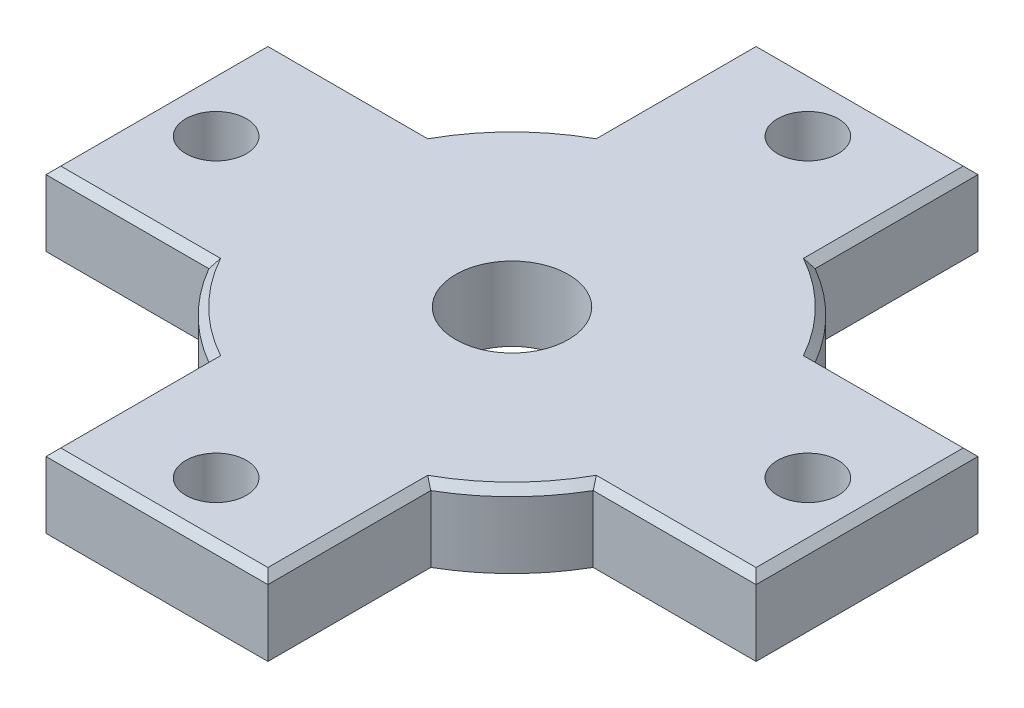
ISO-10303-21;
HEADER;
FILE_DESCRIPTION(('STEP AP214'),'2;1');
FILE_NAME('part.step','',(''),(''),'','','');
FILE_SCHEMA(('AUTOMOTIVE_DESIGN { 1 0 10303 214 1 1 1 1 }'));
ENDSEC;
DATA;
#1=APPLICATION_CONTEXT('core data for automotive mechanical design processes');
#2=APPLICATION_PROTOCOL_DEFINITION('international standard','automotive_design',2000,#1);
#3=PRODUCT_CONTEXT('',#1,'mechanical');
#4=PRODUCT('Part','Part','',(#3));
#5=PRODUCT_RELATED_PRODUCT_CATEGORY('part','',(#4));
#6=PRODUCT_DEFINITION_FORMATION('','',#4);
#7=PRODUCT_DEFINITION_CONTEXT('part definition',#1,'design');
#8=PRODUCT_DEFINITION('design','',#6,#7);
#9=PRODUCT_DEFINITION_SHAPE('','',#8);
#10=(LENGTH_UNIT() NAMED_UNIT(*) SI_UNIT(.MILLI.,.METRE.));
#11=(NAMED_UNIT(*) PLANE_ANGLE_UNIT() SI_UNIT($,.RADIAN.));
#12=(NAMED_UNIT(*) SI_UNIT($,.STERADIAN.) SOLID_ANGLE_UNIT());
#13=UNCERTAINTY_MEASURE_WITH_UNIT(LENGTH_MEASURE(1.E-05),#10,'distance_accuracy_value','');
#14=(GEOMETRIC_REPRESENTATION_CONTEXT(3) GLOBAL_UNCERTAINTY_ASSIGNED_CONTEXT((#13)) GLOBAL_UNIT_ASSIGNED_CONTEXT((#10,
#11,#12)) REPRESENTATION_CONTEXT('',''));
#15=CARTESIAN_POINT('',(0.,0.,0.));
#16=DIRECTION('',(0.,0.,1.));
#17=DIRECTION('',(1.,0.,0.));
#18=AXIS2_PLACEMENT_3D('',#15,#16,#17);
#19=CARTESIAN_POINT('',(0.,10.,0.));
#20=DIRECTION('',(0.,-1.,0.));
#21=DIRECTION('',(0.,0.,-1.));
#22=AXIS2_PLACEMENT_3D('',#19,#20,#21);
#23=CYLINDRICAL_SURFACE('',#22,30.);
#24=DIRECTION('',(0.,-1.,0.));
#25=VECTOR('',#24,1.);
#26=CARTESIAN_POINT('',(-25.9807621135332,10.,-15.));
#27=LINE('',#26,#25);
#28=CARTESIAN_POINT('',(-25.9807621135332,9.00000000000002,-15.));
#29=VERTEX_POINT('',#28);
#30=CARTESIAN_POINT('',(-25.9807621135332,0.,-15.));
#31=VERTEX_POINT('',#30);
#32=EDGE_CURVE('E207',#29,#31,#27,.T.);
#33=ORIENTED_EDGE('',*,*,#32,.F.);
#34=CARTESIAN_POINT('',(0.,9.00000000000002,0.));
#35=DIRECTION('',(0.,1.,0.));
#36=DIRECTION('',(0.,0.,1.));
#37=AXIS2_PLACEMENT_3D('',#34,#35,#36);
#38=CIRCLE('',#37,30.);
#39=CARTESIAN_POINT('',(-15.,9.00000000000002,-25.9807621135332));
#40=VERTEX_POINT('',#39);
#41=EDGE_CURVE('E12',#29,#40,#38,.F.);
#42=ORIENTED_EDGE('',*,*,#41,.T.);
#43=DIRECTION('',(0.,-1.,0.));
#44=VECTOR('',#43,1.);
#45=CARTESIAN_POINT('',(-15.,10.,-25.9807621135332));
#46=LINE('',#45,#44);
#47=CARTESIAN_POINT('',(-15.,0.,-25.9807621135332));
#48=VERTEX_POINT('',#47);
#49=EDGE_CURVE('E228',#40,#48,#46,.T.);
#50=ORIENTED_EDGE('',*,*,#49,.T.);
#51=CARTESIAN_POINT('',(0.,0.,0.));
#52=DIRECTION('',(0.,1.,0.));
#53=DIRECTION('',(0.,0.,1.));
#54=AXIS2_PLACEMENT_3D('',#51,#52,#53);
#55=CIRCLE('',#54,30.);
#56=EDGE_CURVE('E222',#48,#31,#55,.T.);
#57=ORIENTED_EDGE('',*,*,#56,.T.);
#58=EDGE_LOOP('',(#33,#42,#50,#57));
#59=FACE_BOUND('',#58,.T.);
#60=ADVANCED_FACE('F41',(#59),#23,.T.);
#61=CARTESIAN_POINT('',(-48.,10.,-15.));
#62=DIRECTION('',(0.,0.,1.));
#63=DIRECTION('',(1.,0.,0.));
#64=AXIS2_PLACEMENT_3D('',#61,#62,#63);
#65=PLANE('',#64);
#66=DIRECTION('',(0.,-1.,0.));
#67=VECTOR('',#66,1.);
#68=CARTESIAN_POINT('',(-48.,10.,-15.));
#69=LINE('',#68,#67);
#70=CARTESIAN_POINT('',(-48.,9.00000000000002,-15.));
#71=VERTEX_POINT('',#70);
#72=CARTESIAN_POINT('',(-48.,0.,-15.));
#73=VERTEX_POINT('',#72);
#74=EDGE_CURVE('E216',#71,#73,#69,.T.);
#75=ORIENTED_EDGE('',*,*,#74,.F.);
#76=DIRECTION('',(1.,0.,0.));
#77=VECTOR('',#76,1.);
#78=CARTESIAN_POINT('',(-25.9807621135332,9.00000000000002,-15.));
#79=LINE('',#78,#77);
#80=EDGE_CURVE('E56',#71,#29,#79,.T.);
#81=ORIENTED_EDGE('',*,*,#80,.T.);
#82=ORIENTED_EDGE('',*,*,#32,.T.);
#83=DIRECTION('',(-1.,0.,0.));
#84=VECTOR('',#83,1.);
#85=CARTESIAN_POINT('',(-48.,0.,-15.));
#86=LINE('',#85,#84);
#87=EDGE_CURVE('E210',#31,#73,#86,.T.);
#88=ORIENTED_EDGE('',*,*,#87,.T.);
#89=EDGE_LOOP('',(#75,#81,#82,#88));
#90=FACE_BOUND('',#89,.T.);
#91=ADVANCED_FACE('F209',(#90),#65,.F.);
#92=CARTESIAN_POINT('',(-48.,10.,15.));
#93=DIRECTION('',(1.,0.,0.));
#94=DIRECTION('',(0.,0.,-1.));
#95=AXIS2_PLACEMENT_3D('',#92,#93,#94);
#96=PLANE('',#95);
#97=DIRECTION('',(0.,-1.,0.));
#98=VECTOR('',#97,1.);
#99=CARTESIAN_POINT('',(-48.,10.,15.));
#100=LINE('',#99,#98);
#101=CARTESIAN_POINT('',(-48.,9.00000000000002,15.));
#102=VERTEX_POINT('',#101);
#103=CARTESIAN_POINT('',(-48.,0.,15.));
#104=VERTEX_POINT('',#103);
#105=EDGE_CURVE('E301',#102,#104,#100,.T.);
#106=ORIENTED_EDGE('',*,*,#105,.F.);
#107=DIRECTION('',(0.,0.,-1.));
#108=VECTOR('',#107,1.);
#109=CARTESIAN_POINT('',(-48.,9.00000000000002,-15.));
#110=LINE('',#109,#108);
#111=EDGE_CURVE('E71',#102,#71,#110,.T.);
#112=ORIENTED_EDGE('',*,*,#111,.T.);
#113=ORIENTED_EDGE('',*,*,#74,.T.);
#114=DIRECTION('',(0.,0.,1.));
#115=VECTOR('',#114,1.);
#116=CARTESIAN_POINT('',(-48.,0.,15.));
#117=LINE('',#116,#115);
#118=EDGE_CURVE('E225',#73,#104,#117,.T.);
#119=ORIENTED_EDGE('',*,*,#118,.T.);
#120=EDGE_LOOP('',(#106,#112,#113,#119));
#121=FACE_BOUND('',#120,.T.);
#122=ADVANCED_FACE('F549',(#121),#96,.F.);
#123=CARTESIAN_POINT('',(-25.9807621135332,10.,15.));
#124=DIRECTION('',(0.,0.,-1.));
#125=DIRECTION('',(-1.,0.,0.));
#126=AXIS2_PLACEMENT_3D('',#123,#124,#125);
#127=PLANE('',#126);
#128=DIRECTION('',(0.,-1.,0.));
#129=VECTOR('',#128,1.);
#130=CARTESIAN_POINT('',(-25.9807621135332,10.,15.));
#131=LINE('',#130,#129);
#132=CARTESIAN_POINT('',(-25.9807621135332,9.00000000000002,15.));
#133=VERTEX_POINT('',#132);
#134=CARTESIAN_POINT('',(-25.9807621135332,0.,15.));
#135=VERTEX_POINT('',#134);
#136=EDGE_CURVE('E299',#133,#135,#131,.T.);
#137=ORIENTED_EDGE('',*,*,#136,.F.);
#138=DIRECTION('',(-1.,0.,0.));
#139=VECTOR('',#138,1.);
#140=CARTESIAN_POINT('',(-48.,9.00000000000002,15.));
#141=LINE('',#140,#139);
#142=EDGE_CURVE('E361',#133,#102,#141,.T.);
#143=ORIENTED_EDGE('',*,*,#142,.T.);
#144=ORIENTED_EDGE('',*,*,#105,.T.);
#145=DIRECTION('',(1.,0.,0.));
#146=VECTOR('',#145,1.);
#147=CARTESIAN_POINT('',(-25.9807621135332,0.,15.));
#148=LINE('',#147,#146);
#149=EDGE_CURVE('E238',#104,#135,#148,.T.);
#150=ORIENTED_EDGE('',*,*,#149,.T.);
#151=EDGE_LOOP('',(#137,#143,#144,#150));
#152=FACE_BOUND('',#151,.T.);
#153=ADVANCED_FACE('F512',(#152),#127,.F.);
#154=CARTESIAN_POINT('',(0.,10.,0.));
#155=DIRECTION('',(0.,-1.,0.));
#156=DIRECTION('',(0.,0.,-1.));
#157=AXIS2_PLACEMENT_3D('',#154,#155,#156);
#158=CYLINDRICAL_SURFACE('',#157,30.);
#159=DIRECTION('',(0.,-1.,0.));
#160=VECTOR('',#159,1.);
#161=CARTESIAN_POINT('',(-15.,10.,25.9807621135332));
#162=LINE('',#161,#160);
#163=CARTESIAN_POINT('',(-15.,9.00000000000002,25.9807621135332));
#164=VERTEX_POINT('',#163);
#165=CARTESIAN_POINT('',(-15.,0.,25.9807621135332));
#166=VERTEX_POINT('',#165);
#167=EDGE_CURVE('E297',#164,#166,#162,.T.);
#168=ORIENTED_EDGE('',*,*,#167,.F.);
#169=CARTESIAN_POINT('',(0.,9.00000000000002,0.));
#170=DIRECTION('',(0.,1.,0.));
#171=DIRECTION('',(0.,0.,1.));
#172=AXIS2_PLACEMENT_3D('',#169,#170,#171);
#173=CIRCLE('',#172,30.);
#174=EDGE_CURVE('E359',#164,#133,#173,.F.);
#175=ORIENTED_EDGE('',*,*,#174,.T.);
#176=ORIENTED_EDGE('',*,*,#136,.T.);
#177=CARTESIAN_POINT('',(0.,0.,0.));
#178=DIRECTION('',(0.,1.,0.));
#179=DIRECTION('',(0.,0.,1.));
#180=AXIS2_PLACEMENT_3D('',#177,#178,#179);
#181=CIRCLE('',#180,30.);
#182=EDGE_CURVE('E241',#135,#166,#181,.T.);
#183=ORIENTED_EDGE('',*,*,#182,.T.);
#184=EDGE_LOOP('',(#168,#175,#176,#183));
#185=FACE_BOUND('',#184,.T.);
#186=ADVANCED_FACE('F510',(#185),#158,.T.);
#187=CARTESIAN_POINT('',(-15.,10.,48.));
#188=DIRECTION('',(1.,0.,0.));
#189=DIRECTION('',(0.,0.,-1.));
#190=AXIS2_PLACEMENT_3D('',#187,#188,#189);
#191=PLANE('',#190);
#192=DIRECTION('',(0.,-1.,0.));
#193=VECTOR('',#192,1.);
#194=CARTESIAN_POINT('',(-15.,10.,48.));
#195=LINE('',#194,#193);
#196=CARTESIAN_POINT('',(-15.,9.00000000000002,48.));
#197=VERTEX_POINT('',#196);
#198=CARTESIAN_POINT('',(-15.,0.,48.));
#199=VERTEX_POINT('',#198);
#200=EDGE_CURVE('E295',#197,#199,#195,.T.);
#201=ORIENTED_EDGE('',*,*,#200,.F.);
#202=DIRECTION('',(0.,0.,-1.));
#203=VECTOR('',#202,1.);
#204=CARTESIAN_POINT('',(-15.,9.00000000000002,25.9807621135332));
#205=LINE('',#204,#203);
#206=EDGE_CURVE('E357',#197,#164,#205,.T.);
#207=ORIENTED_EDGE('',*,*,#206,.T.);
#208=ORIENTED_EDGE('',*,*,#167,.T.);
#209=DIRECTION('',(0.,0.,1.));
#210=VECTOR('',#209,1.);
#211=CARTESIAN_POINT('',(-15.,0.,48.));
#212=LINE('',#211,#210);
#213=EDGE_CURVE('E244',#166,#199,#212,.T.);
#214=ORIENTED_EDGE('',*,*,#213,.T.);
#215=EDGE_LOOP('',(#201,#207,#208,#214));
#216=FACE_BOUND('',#215,.T.);
#217=ADVANCED_FACE('F519',(#216),#191,.F.);
#218=CARTESIAN_POINT('',(15.,10.,48.));
#219=DIRECTION('',(0.,0.,-1.));
#220=DIRECTION('',(-1.,0.,0.));
#221=AXIS2_PLACEMENT_3D('',#218,#219,#220);
#222=PLANE('',#221);
#223=DIRECTION('',(0.,-1.,0.));
#224=VECTOR('',#223,1.);
#225=CARTESIAN_POINT('',(15.,10.,48.));
#226=LINE('',#225,#224);
#227=CARTESIAN_POINT('',(15.,9.00000000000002,48.));
#228=VERTEX_POINT('',#227);
#229=CARTESIAN_POINT('',(15.,0.,48.));
#230=VERTEX_POINT('',#229);
#231=EDGE_CURVE('E293',#228,#230,#226,.T.);
#232=ORIENTED_EDGE('',*,*,#231,.F.);
#233=DIRECTION('',(-1.,0.,0.));
#234=VECTOR('',#233,1.);
#235=CARTESIAN_POINT('',(-15.,9.00000000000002,48.));
#236=LINE('',#235,#234);
#237=EDGE_CURVE('E355',#228,#197,#236,.T.);
#238=ORIENTED_EDGE('',*,*,#237,.T.);
#239=ORIENTED_EDGE('',*,*,#200,.T.);
#240=DIRECTION('',(1.,0.,0.));
#241=VECTOR('',#240,1.);
#242=CARTESIAN_POINT('',(15.,0.,48.));
#243=LINE('',#242,#241);
#244=EDGE_CURVE('E247',#199,#230,#243,.T.);
#245=ORIENTED_EDGE('',*,*,#244,.T.);
#246=EDGE_LOOP('',(#232,#238,#239,#245));
#247=FACE_BOUND('',#246,.T.);
#248=ADVANCED_FACE('F560',(#247),#222,.F.);
#249=CARTESIAN_POINT('',(15.,10.,25.9807621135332));
#250=DIRECTION('',(-1.,0.,0.));
#251=DIRECTION('',(0.,0.,1.));
#252=AXIS2_PLACEMENT_3D('',#249,#250,#251);
#253=PLANE('',#252);
#254=DIRECTION('',(0.,-1.,0.));
#255=VECTOR('',#254,1.);
#256=CARTESIAN_POINT('',(15.,10.,25.9807621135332));
#257=LINE('',#256,#255);
#258=CARTESIAN_POINT('',(15.,9.00000000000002,25.9807621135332));
#259=VERTEX_POINT('',#258);
#260=CARTESIAN_POINT('',(15.,0.,25.9807621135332));
#261=VERTEX_POINT('',#260);
#262=EDGE_CURVE('E291',#259,#261,#257,.T.);
#263=ORIENTED_EDGE('',*,*,#262,.F.);
#264=DIRECTION('',(0.,0.,1.));
#265=VECTOR('',#264,1.);
#266=CARTESIAN_POINT('',(15.,9.00000000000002,48.));
#267=LINE('',#266,#265);
#268=EDGE_CURVE('E353',#259,#228,#267,.T.);
#269=ORIENTED_EDGE('',*,*,#268,.T.);
#270=ORIENTED_EDGE('',*,*,#231,.T.);
#271=DIRECTION('',(0.,0.,-1.));
#272=VECTOR('',#271,1.);
#273=CARTESIAN_POINT('',(15.,0.,25.9807621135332));
#274=LINE('',#273,#272);
#275=EDGE_CURVE('E250',#230,#261,#274,.T.);
#276=ORIENTED_EDGE('',*,*,#275,.T.);
#277=EDGE_LOOP('',(#263,#269,#270,#276));
#278=FACE_BOUND('',#277,.T.);
#279=ADVANCED_FACE('F563',(#278),#253,.F.);
#280=CARTESIAN_POINT('',(0.,10.,0.));
#281=DIRECTION('',(0.,-1.,0.));
#282=DIRECTION('',(0.,0.,-1.));
#283=AXIS2_PLACEMENT_3D('',#280,#281,#282);
#284=CYLINDRICAL_SURFACE('',#283,30.);
#285=DIRECTION('',(0.,-1.,0.));
#286=VECTOR('',#285,1.);
#287=CARTESIAN_POINT('',(25.9807621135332,10.,15.));
#288=LINE('',#287,#286);
#289=CARTESIAN_POINT('',(25.9807621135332,9.00000000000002,15.));
#290=VERTEX_POINT('',#289);
#291=CARTESIAN_POINT('',(25.9807621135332,0.,15.));
#292=VERTEX_POINT('',#291);
#293=EDGE_CURVE('E289',#290,#292,#288,.T.);
#294=ORIENTED_EDGE('',*,*,#293,.F.);
#295=CARTESIAN_POINT('',(0.,9.00000000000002,0.));
#296=DIRECTION('',(0.,1.,0.));
#297=DIRECTION('',(0.,0.,1.));
#298=AXIS2_PLACEMENT_3D('',#295,#296,#297);
#299=CIRCLE('',#298,30.);
#300=EDGE_CURVE('E351',#290,#259,#299,.F.);
#301=ORIENTED_EDGE('',*,*,#300,.T.);
#302=ORIENTED_EDGE('',*,*,#262,.T.);
#303=CARTESIAN_POINT('',(0.,0.,0.));
#304=DIRECTION('',(0.,1.,0.));
#305=DIRECTION('',(0.,0.,1.));
#306=AXIS2_PLACEMENT_3D('',#303,#304,#305);
#307=CIRCLE('',#306,30.);
#308=EDGE_CURVE('E253',#261,#292,#307,.T.);
#309=ORIENTED_EDGE('',*,*,#308,.T.);
#310=EDGE_LOOP('',(#294,#301,#302,#309));
#311=FACE_BOUND('',#310,.T.);
#312=ADVANCED_FACE('F535',(#311),#284,.T.);
#313=CARTESIAN_POINT('',(48.,10.,15.));
#314=DIRECTION('',(0.,0.,-1.));
#315=DIRECTION('',(-1.,0.,0.));
#316=AXIS2_PLACEMENT_3D('',#313,#314,#315);
#317=PLANE('',#316);
#318=DIRECTION('',(0.,-1.,0.));
#319=VECTOR('',#318,1.);
#320=CARTESIAN_POINT('',(48.,10.,15.));
#321=LINE('',#320,#319);
#322=CARTESIAN_POINT('',(48.,9.00000000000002,15.));
#323=VERTEX_POINT('',#322);
#324=CARTESIAN_POINT('',(48.,0.,15.));
#325=VERTEX_POINT('',#324);
#326=EDGE_CURVE('E287',#323,#325,#321,.T.);
#327=ORIENTED_EDGE('',*,*,#326,.F.);
#328=DIRECTION('',(-1.,0.,0.));
#329=VECTOR('',#328,1.);
#330=CARTESIAN_POINT('',(25.9807621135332,9.00000000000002,15.));
#331=LINE('',#330,#329);
#332=EDGE_CURVE('E349',#323,#290,#331,.T.);
#333=ORIENTED_EDGE('',*,*,#332,.T.);
#334=ORIENTED_EDGE('',*,*,#293,.T.);
#335=DIRECTION('',(1.,0.,0.));
#336=VECTOR('',#335,1.);
#337=CARTESIAN_POINT('',(48.,0.,15.));
#338=LINE('',#337,#336);
#339=EDGE_CURVE('E256',#292,#325,#338,.T.);
#340=ORIENTED_EDGE('',*,*,#339,.T.);
#341=EDGE_LOOP('',(#327,#333,#334,#340));
#342=FACE_BOUND('',#341,.T.);
#343=ADVANCED_FACE('F532',(#342),#317,.F.);
#344=CARTESIAN_POINT('',(48.,10.,-15.));
#345=DIRECTION('',(-1.,0.,0.));
#346=DIRECTION('',(0.,0.,1.));
#347=AXIS2_PLACEMENT_3D('',#344,#345,#346);
#348=PLANE('',#347);
#349=DIRECTION('',(0.,-1.,0.));
#350=VECTOR('',#349,1.);
#351=CARTESIAN_POINT('',(48.,10.,-15.));
#352=LINE('',#351,#350);
#353=CARTESIAN_POINT('',(48.,9.00000000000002,-15.));
#354=VERTEX_POINT('',#353);
#355=CARTESIAN_POINT('',(48.,0.,-15.));
#356=VERTEX_POINT('',#355);
#357=EDGE_CURVE('E285',#354,#356,#352,.T.);
#358=ORIENTED_EDGE('',*,*,#357,.F.);
#359=DIRECTION('',(0.,0.,1.));
#360=VECTOR('',#359,1.);
#361=CARTESIAN_POINT('',(48.,9.00000000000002,15.));
#362=LINE('',#361,#360);
#363=EDGE_CURVE('E347',#354,#323,#362,.T.);
#364=ORIENTED_EDGE('',*,*,#363,.T.);
#365=ORIENTED_EDGE('',*,*,#326,.T.);
#366=DIRECTION('',(0.,0.,-1.));
#367=VECTOR('',#366,1.);
#368=CARTESIAN_POINT('',(48.,0.,-15.));
#369=LINE('',#368,#367);
#370=EDGE_CURVE('E259',#325,#356,#369,.T.);
#371=ORIENTED_EDGE('',*,*,#370,.T.);
#372=EDGE_LOOP('',(#358,#364,#365,#371));
#373=FACE_BOUND('',#372,.T.);
#374=ADVANCED_FACE('F571',(#373),#348,.F.);
#375=CARTESIAN_POINT('',(25.9807621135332,10.,-15.));
#376=DIRECTION('',(0.,0.,1.));
#377=DIRECTION('',(1.,0.,0.));
#378=AXIS2_PLACEMENT_3D('',#375,#376,#377);
#379=PLANE('',#378);
#380=DIRECTION('',(0.,-1.,0.));
#381=VECTOR('',#380,1.);
#382=CARTESIAN_POINT('',(25.9807621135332,10.,-15.));
#383=LINE('',#382,#381);
#384=CARTESIAN_POINT('',(25.9807621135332,9.00000000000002,-15.));
#385=VERTEX_POINT('',#384);
#386=CARTESIAN_POINT('',(25.9807621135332,0.,-15.));
#387=VERTEX_POINT('',#386);
#388=EDGE_CURVE('E283',#385,#387,#383,.T.);
#389=ORIENTED_EDGE('',*,*,#388,.F.);
#390=DIRECTION('',(1.,0.,0.));
#391=VECTOR('',#390,1.);
#392=CARTESIAN_POINT('',(48.,9.00000000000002,-15.));
#393=LINE('',#392,#391);
#394=EDGE_CURVE('E345',#385,#354,#393,.T.);
#395=ORIENTED_EDGE('',*,*,#394,.T.);
#396=ORIENTED_EDGE('',*,*,#357,.T.);
#397=DIRECTION('',(-1.,0.,0.));
#398=VECTOR('',#397,1.);
#399=CARTESIAN_POINT('',(25.9807621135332,0.,-15.));
#400=LINE('',#399,#398);
#401=EDGE_CURVE('E262',#356,#387,#400,.T.);
#402=ORIENTED_EDGE('',*,*,#401,.T.);
#403=EDGE_LOOP('',(#389,#395,#396,#402));
#404=FACE_BOUND('',#403,.T.);
#405=ADVANCED_FACE('F574',(#404),#379,.F.);
#406=CARTESIAN_POINT('',(0.,10.,0.));
#407=DIRECTION('',(0.,-1.,0.));
#408=DIRECTION('',(0.,0.,-1.));
#409=AXIS2_PLACEMENT_3D('',#406,#407,#408);
#410=CYLINDRICAL_SURFACE('',#409,30.);
#411=DIRECTION('',(0.,-1.,0.));
#412=VECTOR('',#411,1.);
#413=CARTESIAN_POINT('',(15.,10.,-25.9807621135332));
#414=LINE('',#413,#412);
#415=CARTESIAN_POINT('',(15.,9.00000000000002,-25.9807621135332));
#416=VERTEX_POINT('',#415);
#417=CARTESIAN_POINT('',(15.,0.,-25.9807621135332));
#418=VERTEX_POINT('',#417);
#419=EDGE_CURVE('E281',#416,#418,#414,.T.);
#420=ORIENTED_EDGE('',*,*,#419,.F.);
#421=CARTESIAN_POINT('',(0.,9.00000000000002,0.));
#422=DIRECTION('',(0.,1.,0.));
#423=DIRECTION('',(0.,0.,1.));
#424=AXIS2_PLACEMENT_3D('',#421,#422,#423);
#425=CIRCLE('',#424,30.);
#426=EDGE_CURVE('E343',#416,#385,#425,.F.);
#427=ORIENTED_EDGE('',*,*,#426,.T.);
#428=ORIENTED_EDGE('',*,*,#388,.T.);
#429=CARTESIAN_POINT('',(0.,0.,0.));
#430=DIRECTION('',(0.,1.,0.));
#431=DIRECTION('',(0.,0.,1.));
#432=AXIS2_PLACEMENT_3D('',#429,#430,#431);
#433=CIRCLE('',#432,30.);
#434=EDGE_CURVE('E265',#387,#418,#433,.T.);
#435=ORIENTED_EDGE('',*,*,#434,.T.);
#436=EDGE_LOOP('',(#420,#427,#428,#435));
#437=FACE_BOUND('',#436,.T.);
#438=ADVANCED_FACE('F578',(#437),#410,.T.);
#439=CARTESIAN_POINT('',(15.,10.,-48.));
#440=DIRECTION('',(-1.,0.,0.));
#441=DIRECTION('',(0.,0.,1.));
#442=AXIS2_PLACEMENT_3D('',#439,#440,#441);
#443=PLANE('',#442);
#444=DIRECTION('',(0.,-1.,0.));
#445=VECTOR('',#444,1.);
#446=CARTESIAN_POINT('',(15.,10.,-48.));
#447=LINE('',#446,#445);
#448=CARTESIAN_POINT('',(15.,9.00000000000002,-48.));
#449=VERTEX_POINT('',#448);
#450=CARTESIAN_POINT('',(15.,0.,-48.));
#451=VERTEX_POINT('',#450);
#452=EDGE_CURVE('E279',#449,#451,#447,.T.);
#453=ORIENTED_EDGE('',*,*,#452,.F.);
#454=DIRECTION('',(0.,0.,1.));
#455=VECTOR('',#454,1.);
#456=CARTESIAN_POINT('',(15.,9.00000000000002,-25.9807621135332));
#457=LINE('',#456,#455);
#458=EDGE_CURVE('E341',#449,#416,#457,.T.);
#459=ORIENTED_EDGE('',*,*,#458,.T.);
#460=ORIENTED_EDGE('',*,*,#419,.T.);
#461=DIRECTION('',(0.,0.,-1.));
#462=VECTOR('',#461,1.);
#463=CARTESIAN_POINT('',(15.,0.,-48.));
#464=LINE('',#463,#462);
#465=EDGE_CURVE('E268',#418,#451,#464,.T.);
#466=ORIENTED_EDGE('',*,*,#465,.T.);
#467=EDGE_LOOP('',(#453,#459,#460,#466));
#468=FACE_BOUND('',#467,.T.);
#469=ADVANCED_FACE('F582',(#468),#443,.F.);
#470=CARTESIAN_POINT('',(-15.,10.,-48.));
#471=DIRECTION('',(0.,0.,1.));
#472=DIRECTION('',(1.,0.,0.));
#473=AXIS2_PLACEMENT_3D('',#470,#471,#472);
#474=PLANE('',#473);
#475=DIRECTION('',(0.,-1.,0.));
#476=VECTOR('',#475,1.);
#477=CARTESIAN_POINT('',(-15.,10.,-48.));
#478=LINE('',#477,#476);
#479=CARTESIAN_POINT('',(-15.,9.00000000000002,-48.));
#480=VERTEX_POINT('',#479);
#481=CARTESIAN_POINT('',(-15.,0.,-48.));
#482=VERTEX_POINT('',#481);
#483=EDGE_CURVE('E277',#480,#482,#478,.T.);
#484=ORIENTED_EDGE('',*,*,#483,.F.);
#485=DIRECTION('',(1.,0.,0.));
#486=VECTOR('',#485,1.);
#487=CARTESIAN_POINT('',(15.,9.00000000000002,-48.));
#488=LINE('',#487,#486);
#489=EDGE_CURVE('E339',#480,#449,#488,.T.);
#490=ORIENTED_EDGE('',*,*,#489,.T.);
#491=ORIENTED_EDGE('',*,*,#452,.T.);
#492=DIRECTION('',(-1.,0.,0.));
#493=VECTOR('',#492,1.);
#494=CARTESIAN_POINT('',(-15.,0.,-48.));
#495=LINE('',#494,#493);
#496=EDGE_CURVE('E271',#451,#482,#495,.T.);
#497=ORIENTED_EDGE('',*,*,#496,.T.);
#498=EDGE_LOOP('',(#484,#490,#491,#497));
#499=FACE_BOUND('',#498,.T.);
#500=ADVANCED_FACE('F586',(#499),#474,.F.);
#501=CARTESIAN_POINT('',(-15.,10.,-25.9807621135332));
#502=DIRECTION('',(1.,0.,0.));
#503=DIRECTION('',(0.,0.,-1.));
#504=AXIS2_PLACEMENT_3D('',#501,#502,#503);
#505=PLANE('',#504);
#506=ORIENTED_EDGE('',*,*,#49,.F.);
#507=DIRECTION('',(0.,0.,-1.));
#508=VECTOR('',#507,1.);
#509=CARTESIAN_POINT('',(-15.,9.00000000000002,-48.));
#510=LINE('',#509,#508);
#511=EDGE_CURVE('E336',#40,#480,#510,.T.);
#512=ORIENTED_EDGE('',*,*,#511,.T.);
#513=ORIENTED_EDGE('',*,*,#483,.T.);
#514=DIRECTION('',(0.,0.,1.));
#515=VECTOR('',#514,1.);
#516=CARTESIAN_POINT('',(-15.,0.,-25.9807621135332));
#517=LINE('',#516,#515);
#518=EDGE_CURVE('E274',#482,#48,#517,.T.);
#519=ORIENTED_EDGE('',*,*,#518,.T.);
#520=EDGE_LOOP('',(#506,#512,#513,#519));
#521=FACE_BOUND('',#520,.T.);
#522=ADVANCED_FACE('F590',(#521),#505,.F.);
#523=CARTESIAN_POINT('',(0.,10.,0.));
#524=DIRECTION('',(0.,1.,0.));
#525=DIRECTION('',(0.,0.,1.));
#526=AXIS2_PLACEMENT_3D('',#523,#524,#525);
#527=PLANE('',#526);
#528=CARTESIAN_POINT('',(40.,10.,-1.39659253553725E-13));
#529=DIRECTION('',(0.,1.,0.));
#530=DIRECTION('',(1.,0.,0.));
#531=AXIS2_PLACEMENT_3D('',#528,#529,#530);
#532=CIRCLE('',#531,4.1);
#533=CARTESIAN_POINT('',(44.1,10.,-1.53974327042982E-13));
#534=VERTEX_POINT('',#533);
#535=EDGE_CURVE('E628',#534,#534,#532,.T.);
#536=ORIENTED_EDGE('',*,*,#535,.F.);
#537=EDGE_LOOP('',(#536));
#538=FACE_BOUND('',#537,.T.);
#539=CARTESIAN_POINT('',(0.,10.,-40.));
#540=DIRECTION('',(0.,1.,0.));
#541=DIRECTION('',(0.,0.,-1.));
#542=AXIS2_PLACEMENT_3D('',#539,#540,#541);
#543=CIRCLE('',#542,4.1);
#544=CARTESIAN_POINT('',(0.,10.,-44.1));
#545=VERTEX_POINT('',#544);
#546=EDGE_CURVE('E634',#545,#545,#543,.T.);
#547=ORIENTED_EDGE('',*,*,#546,.F.);
#548=EDGE_LOOP('',(#547));
#549=FACE_BOUND('',#548,.T.);
#550=CARTESIAN_POINT('',(-40.,10.,4.18977760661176E-13));
#551=DIRECTION('',(0.,1.,0.));
#552=DIRECTION('',(-1.,0.,0.));
#553=AXIS2_PLACEMENT_3D('',#550,#551,#552);
#554=CIRCLE('',#553,4.1);
#555=CARTESIAN_POINT('',(-44.1,10.,4.61922981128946E-13));
#556=VERTEX_POINT('',#555);
#557=EDGE_CURVE('E640',#556,#556,#554,.T.);
#558=ORIENTED_EDGE('',*,*,#557,.F.);
#559=EDGE_LOOP('',(#558));
#560=FACE_BOUND('',#559,.T.);
#561=CARTESIAN_POINT('',(0.,10.,40.));
#562=DIRECTION('',(0.,1.,0.));
#563=DIRECTION('',(0.,0.,1.));
#564=AXIS2_PLACEMENT_3D('',#561,#562,#563);
#565=CIRCLE('',#564,4.1);
#566=CARTESIAN_POINT('',(0.,10.,44.1));
#567=VERTEX_POINT('',#566);
#568=EDGE_CURVE('E629',#567,#567,#565,.T.);
#569=ORIENTED_EDGE('',*,*,#568,.F.);
#570=EDGE_LOOP('',(#569));
#571=FACE_BOUND('',#570,.T.);
#572=CARTESIAN_POINT('',(0.,10.,0.));
#573=DIRECTION('',(0.,1.,0.));
#574=DIRECTION('',(0.,0.,1.));
#575=AXIS2_PLACEMENT_3D('',#572,#573,#574);
#576=CIRCLE('',#575,7.625);
#577=CARTESIAN_POINT('',(0.,10.,7.625));
#578=VERTEX_POINT('',#577);
#579=EDGE_CURVE('E649',#578,#578,#576,.T.);
#580=ORIENTED_EDGE('',*,*,#579,.F.);
#581=EDGE_LOOP('',(#580));
#582=FACE_BOUND('',#581,.T.);
#583=DIRECTION('',(-1.,0.,0.));
#584=VECTOR('',#583,1.);
#585=CARTESIAN_POINT('',(-15.,10.,-47.));
#586=LINE('',#585,#584);
#587=CARTESIAN_POINT('',(14.,10.,-47.));
#588=VERTEX_POINT('',#587);
#589=CARTESIAN_POINT('',(-14.,10.,-47.));
#590=VERTEX_POINT('',#589);
#591=EDGE_CURVE('E331',#588,#590,#586,.T.);
#592=ORIENTED_EDGE('',*,*,#591,.T.);
#593=DIRECTION('',(0.,0.,1.));
#594=VECTOR('',#593,1.);
#595=CARTESIAN_POINT('',(-14.,10.,-25.9807621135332));
#596=LINE('',#595,#594);
#597=CARTESIAN_POINT('',(-14.,10.,-25.3968501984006));
#598=VERTEX_POINT('',#597);
#599=EDGE_CURVE('E333',#590,#598,#596,.T.);
#600=ORIENTED_EDGE('',*,*,#599,.T.);
#601=CARTESIAN_POINT('',(0.,10.,0.));
#602=DIRECTION('',(0.,1.,0.));
#603=DIRECTION('',(0.,0.,1.));
#604=AXIS2_PLACEMENT_3D('',#601,#602,#603);
#605=CIRCLE('',#604,29.);
#606=CARTESIAN_POINT('',(-25.3968501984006,10.,-14.));
#607=VERTEX_POINT('',#606);
#608=EDGE_CURVE('E215',#598,#607,#605,.T.);
#609=ORIENTED_EDGE('',*,*,#608,.T.);
#610=DIRECTION('',(-1.,0.,0.));
#611=VECTOR('',#610,1.);
#612=CARTESIAN_POINT('',(-48.,10.,-14.));
#613=LINE('',#612,#611);
#614=CARTESIAN_POINT('',(-47.,10.,-14.));
#615=VERTEX_POINT('',#614);
#616=EDGE_CURVE('E305',#607,#615,#613,.T.);
#617=ORIENTED_EDGE('',*,*,#616,.T.);
#618=DIRECTION('',(0.,0.,1.));
#619=VECTOR('',#618,1.);
#620=CARTESIAN_POINT('',(-47.,10.,15.));
#621=LINE('',#620,#619);
#622=CARTESIAN_POINT('',(-47.,10.,14.));
#623=VERTEX_POINT('',#622);
#624=EDGE_CURVE('E307',#615,#623,#621,.T.);
#625=ORIENTED_EDGE('',*,*,#624,.T.);
#626=DIRECTION('',(1.,0.,0.));
#627=VECTOR('',#626,1.);
#628=CARTESIAN_POINT('',(-25.9807621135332,10.,14.));
#629=LINE('',#628,#627);
#630=CARTESIAN_POINT('',(-25.3968501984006,10.,14.));
#631=VERTEX_POINT('',#630);
#632=EDGE_CURVE('E309',#623,#631,#629,.T.);
#633=ORIENTED_EDGE('',*,*,#632,.T.);
#634=CARTESIAN_POINT('',(0.,10.,0.));
#635=DIRECTION('',(0.,1.,0.));
#636=DIRECTION('',(0.,0.,1.));
#637=AXIS2_PLACEMENT_3D('',#634,#635,#636);
#638=CIRCLE('',#637,29.);
#639=CARTESIAN_POINT('',(-14.,10.,25.3968501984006));
#640=VERTEX_POINT('',#639);
#641=EDGE_CURVE('E311',#631,#640,#638,.T.);
#642=ORIENTED_EDGE('',*,*,#641,.T.);
#643=DIRECTION('',(0.,0.,1.));
#644=VECTOR('',#643,1.);
#645=CARTESIAN_POINT('',(-14.,10.,48.));
#646=LINE('',#645,#644);
#647=CARTESIAN_POINT('',(-14.,10.,47.));
#648=VERTEX_POINT('',#647);
#649=EDGE_CURVE('E313',#640,#648,#646,.T.);
#650=ORIENTED_EDGE('',*,*,#649,.T.);
#651=DIRECTION('',(1.,0.,0.));
#652=VECTOR('',#651,1.);
#653=CARTESIAN_POINT('',(15.,10.,47.));
#654=LINE('',#653,#652);
#655=CARTESIAN_POINT('',(14.,10.,47.));
#656=VERTEX_POINT('',#655);
#657=EDGE_CURVE('E315',#648,#656,#654,.T.);
#658=ORIENTED_EDGE('',*,*,#657,.T.);
#659=DIRECTION('',(0.,0.,-1.));
#660=VECTOR('',#659,1.);
#661=CARTESIAN_POINT('',(14.,10.,25.9807621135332));
#662=LINE('',#661,#660);
#663=CARTESIAN_POINT('',(14.,10.,25.3968501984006));
#664=VERTEX_POINT('',#663);
#665=EDGE_CURVE('E317',#656,#664,#662,.T.);
#666=ORIENTED_EDGE('',*,*,#665,.T.);
#667=CARTESIAN_POINT('',(0.,10.,0.));
#668=DIRECTION('',(0.,1.,0.));
#669=DIRECTION('',(0.,0.,1.));
#670=AXIS2_PLACEMENT_3D('',#667,#668,#669);
#671=CIRCLE('',#670,29.);
#672=CARTESIAN_POINT('',(25.3968501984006,10.,14.));
#673=VERTEX_POINT('',#672);
#674=EDGE_CURVE('E319',#664,#673,#671,.T.);
#675=ORIENTED_EDGE('',*,*,#674,.T.);
#676=DIRECTION('',(1.,0.,0.));
#677=VECTOR('',#676,1.);
#678=CARTESIAN_POINT('',(48.,10.,14.));
#679=LINE('',#678,#677);
#680=CARTESIAN_POINT('',(47.,10.,14.));
#681=VERTEX_POINT('',#680);
#682=EDGE_CURVE('E321',#673,#681,#679,.T.);
#683=ORIENTED_EDGE('',*,*,#682,.T.);
#684=DIRECTION('',(0.,0.,-1.));
#685=VECTOR('',#684,1.);
#686=CARTESIAN_POINT('',(47.,10.,-15.));
#687=LINE('',#686,#685);
#688=CARTESIAN_POINT('',(47.,10.,-14.));
#689=VERTEX_POINT('',#688);
#690=EDGE_CURVE('E323',#681,#689,#687,.T.);
#691=ORIENTED_EDGE('',*,*,#690,.T.);
#692=DIRECTION('',(-1.,0.,0.));
#693=VECTOR('',#692,1.);
#694=CARTESIAN_POINT('',(25.9807621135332,10.,-14.));
#695=LINE('',#694,#693);
#696=CARTESIAN_POINT('',(25.3968501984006,10.,-14.));
#697=VERTEX_POINT('',#696);
#698=EDGE_CURVE('E325',#689,#697,#695,.T.);
#699=ORIENTED_EDGE('',*,*,#698,.T.);
#700=CARTESIAN_POINT('',(0.,10.,0.));
#701=DIRECTION('',(0.,1.,0.));
#702=DIRECTION('',(0.,0.,1.));
#703=AXIS2_PLACEMENT_3D('',#700,#701,#702);
#704=CIRCLE('',#703,29.);
#705=CARTESIAN_POINT('',(14.,10.,-25.3968501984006));
#706=VERTEX_POINT('',#705);
#707=EDGE_CURVE('E327',#697,#706,#704,.T.);
#708=ORIENTED_EDGE('',*,*,#707,.T.);
#709=DIRECTION('',(0.,0.,-1.));
#710=VECTOR('',#709,1.);
#711=CARTESIAN_POINT('',(14.,10.,-48.));
#712=LINE('',#711,#710);
#713=EDGE_CURVE('E329',#706,#588,#712,.T.);
#714=ORIENTED_EDGE('',*,*,#713,.T.);
#715=EDGE_LOOP('',(#592,#600,#609,#617,#625,#633,#642,#650,#658,#666,#675,#683,#691,#699,#708,#714));
#716=FACE_BOUND('',#715,.T.);
#717=ADVANCED_FACE('F497',(#538,#549,#560,#571,#582,#716),#527,.T.);
#718=CARTESIAN_POINT('',(0.,0.,0.));
#719=DIRECTION('',(0.,1.,0.));
#720=DIRECTION('',(0.,0.,1.));
#721=AXIS2_PLACEMENT_3D('',#718,#719,#720);
#722=PLANE('',#721);
#723=CARTESIAN_POINT('',(40.,0.,-1.39659253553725E-13));
#724=DIRECTION('',(0.,1.,0.));
#725=DIRECTION('',(1.,0.,0.));
#726=AXIS2_PLACEMENT_3D('',#723,#724,#725);
#727=CIRCLE('',#726,4.1);
#728=CARTESIAN_POINT('',(44.1,0.,-1.53974327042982E-13));
#729=VERTEX_POINT('',#728);
#730=EDGE_CURVE('E625',#729,#729,#727,.T.);
#731=ORIENTED_EDGE('',*,*,#730,.T.);
#732=EDGE_LOOP('',(#731));
#733=FACE_BOUND('',#732,.T.);
#734=CARTESIAN_POINT('',(0.,0.,-40.));
#735=DIRECTION('',(0.,1.,0.));
#736=DIRECTION('',(0.,0.,-1.));
#737=AXIS2_PLACEMENT_3D('',#734,#735,#736);
#738=CIRCLE('',#737,4.1);
#739=CARTESIAN_POINT('',(0.,0.,-44.1));
#740=VERTEX_POINT('',#739);
#741=EDGE_CURVE('E637',#740,#740,#738,.T.);
#742=ORIENTED_EDGE('',*,*,#741,.T.);
#743=EDGE_LOOP('',(#742));
#744=FACE_BOUND('',#743,.T.);
#745=CARTESIAN_POINT('',(-40.,0.,4.18977760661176E-13));
#746=DIRECTION('',(0.,1.,0.));
#747=DIRECTION('',(-1.,0.,0.));
#748=AXIS2_PLACEMENT_3D('',#745,#746,#747);
#749=CIRCLE('',#748,4.1);
#750=CARTESIAN_POINT('',(-44.1,0.,4.61922981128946E-13));
#751=VERTEX_POINT('',#750);
#752=EDGE_CURVE('E643',#751,#751,#749,.T.);
#753=ORIENTED_EDGE('',*,*,#752,.T.);
#754=EDGE_LOOP('',(#753));
#755=FACE_BOUND('',#754,.T.);
#756=CARTESIAN_POINT('',(0.,0.,40.));
#757=DIRECTION('',(0.,1.,0.));
#758=DIRECTION('',(0.,0.,1.));
#759=AXIS2_PLACEMENT_3D('',#756,#757,#758);
#760=CIRCLE('',#759,4.1);
#761=CARTESIAN_POINT('',(0.,0.,44.1));
#762=VERTEX_POINT('',#761);
#763=EDGE_CURVE('E632',#762,#762,#760,.T.);
#764=ORIENTED_EDGE('',*,*,#763,.T.);
#765=EDGE_LOOP('',(#764));
#766=FACE_BOUND('',#765,.T.);
#767=CARTESIAN_POINT('',(0.,0.,0.));
#768=DIRECTION('',(0.,1.,0.));
#769=DIRECTION('',(0.,0.,1.));
#770=AXIS2_PLACEMENT_3D('',#767,#768,#769);
#771=CIRCLE('',#770,7.62499999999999);
#772=CARTESIAN_POINT('',(0.,0.,7.62499999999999));
#773=VERTEX_POINT('',#772);
#774=EDGE_CURVE('E234',#773,#773,#771,.T.);
#775=ORIENTED_EDGE('',*,*,#774,.T.);
#776=EDGE_LOOP('',(#775));
#777=FACE_BOUND('',#776,.T.);
#778=ORIENTED_EDGE('',*,*,#56,.F.);
#779=ORIENTED_EDGE('',*,*,#518,.F.);
#780=ORIENTED_EDGE('',*,*,#496,.F.);
#781=ORIENTED_EDGE('',*,*,#465,.F.);
#782=ORIENTED_EDGE('',*,*,#434,.F.);
#783=ORIENTED_EDGE('',*,*,#401,.F.);
#784=ORIENTED_EDGE('',*,*,#370,.F.);
#785=ORIENTED_EDGE('',*,*,#339,.F.);
#786=ORIENTED_EDGE('',*,*,#308,.F.);
#787=ORIENTED_EDGE('',*,*,#275,.F.);
#788=ORIENTED_EDGE('',*,*,#244,.F.);
#789=ORIENTED_EDGE('',*,*,#213,.F.);
#790=ORIENTED_EDGE('',*,*,#182,.F.);
#791=ORIENTED_EDGE('',*,*,#149,.F.);
#792=ORIENTED_EDGE('',*,*,#118,.F.);
#793=ORIENTED_EDGE('',*,*,#87,.F.);
#794=EDGE_LOOP('',(#778,#779,#780,#781,#782,#783,#784,#785,#786,#787,#788,#789,#790,#791,#792,#793));
#795=FACE_BOUND('',#794,.T.);
#796=ADVANCED_FACE('F220',(#733,#744,#755,#766,#777,#795),#722,.F.);
#797=CARTESIAN_POINT('',(14.,10.,0.));
#798=DIRECTION('',(0.707106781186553,0.707106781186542,0.));
#799=DIRECTION('',(0.,0.,1.));
#800=AXIS2_PLACEMENT_3D('',#797,#798,#799);
#801=PLANE('',#800);
#802=DIRECTION('',(-0.577350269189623,0.577350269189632,-0.577350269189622));
#803=VECTOR('',#802,1.);
#804=CARTESIAN_POINT('',(9.3333333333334,14.6666666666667,42.3333333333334));
#805=LINE('',#804,#803);
#806=EDGE_CURVE('E232',#228,#656,#805,.T.);
#807=ORIENTED_EDGE('',*,*,#806,.F.);
#808=ORIENTED_EDGE('',*,*,#268,.F.);
#809=CARTESIAN_POINT('',(15.,9.00000000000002,25.9807621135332));
#810=CARTESIAN_POINT('',(14.8330574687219,9.16694253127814,25.8843883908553));
#811=CARTESIAN_POINT('',(14.6662528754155,9.33374712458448,25.7875422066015));
#812=CARTESIAN_POINT('',(14.3329195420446,9.66708045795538,25.5929049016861));
#813=CARTESIAN_POINT('',(14.1663908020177,9.83360919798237,25.4951137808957));
#814=CARTESIAN_POINT('',(14.,10.,25.3968501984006));
#815=B_SPLINE_CURVE_WITH_KNOTS('',3,(#809,#810,#811,#812,#813,#814),.UNSPECIFIED.,.F.,.F.,(4,2,
4),(0.,0.765010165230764,1.53002043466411),.UNSPECIFIED.);
#816=EDGE_CURVE('E46',#664,#259,#815,.F.);
#817=ORIENTED_EDGE('',*,*,#816,.F.);
#818=ORIENTED_EDGE('',*,*,#665,.F.);
#819=EDGE_LOOP('',(#807,#808,#817,#818));
#820=FACE_BOUND('',#819,.T.);
#821=ADVANCED_FACE('F43',(#820),#801,.T.);
#822=CARTESIAN_POINT('',(0.,10.,0.));
#823=DIRECTION('',(0.,-1.,0.));
#824=DIRECTION('',(0.,0.,-1.));
#825=AXIS2_PLACEMENT_3D('',#822,#823,#824);
#826=CONICAL_SURFACE('',#825,29.,0.78539816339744);
#827=ORIENTED_EDGE('',*,*,#816,.T.);
#828=ORIENTED_EDGE('',*,*,#300,.F.);
#829=CARTESIAN_POINT('',(25.9807621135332,9.00000000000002,15.));
#830=CARTESIAN_POINT('',(25.8843883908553,9.16694253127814,14.8330574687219));
#831=CARTESIAN_POINT('',(25.7875422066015,9.33374712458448,14.6662528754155));
#832=CARTESIAN_POINT('',(25.5929049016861,9.66708045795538,14.3329195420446));
#833=CARTESIAN_POINT('',(25.4951137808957,9.83360919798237,14.1663908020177));
#834=CARTESIAN_POINT('',(25.3968501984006,10.,14.));
#835=B_SPLINE_CURVE_WITH_KNOTS('',3,(#829,#830,#831,#832,#833,#834),.UNSPECIFIED.,.F.,.F.,(4,2,
4),(0.,0.765010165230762,1.53002043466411),.UNSPECIFIED.);
#836=EDGE_CURVE('E477',#673,#290,#835,.F.);
#837=ORIENTED_EDGE('',*,*,#836,.F.);
#838=ORIENTED_EDGE('',*,*,#674,.F.);
#839=EDGE_LOOP('',(#827,#828,#837,#838));
#840=FACE_BOUND('',#839,.T.);
#841=ADVANCED_FACE('F474',(#840),#826,.T.);
#842=CARTESIAN_POINT('',(0.,10.,47.));
#843=DIRECTION('',(0.,0.707106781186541,0.707106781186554));
#844=DIRECTION('',(-1.,0.,0.));
#845=AXIS2_PLACEMENT_3D('',#842,#843,#844);
#846=PLANE('',#845);
#847=ORIENTED_EDGE('',*,*,#806,.T.);
#848=ORIENTED_EDGE('',*,*,#657,.F.);
#849=DIRECTION('',(0.577350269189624,0.577350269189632,-0.577350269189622));
#850=VECTOR('',#849,1.);
#851=CARTESIAN_POINT('',(1.66666666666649,25.6666666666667,31.3333333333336));
#852=LINE('',#851,#850);
#853=EDGE_CURVE('E483',#197,#648,#852,.T.);
#854=ORIENTED_EDGE('',*,*,#853,.F.);
#855=ORIENTED_EDGE('',*,*,#237,.F.);
#856=EDGE_LOOP('',(#847,#848,#854,#855));
#857=FACE_BOUND('',#856,.T.);
#858=ADVANCED_FACE('F472',(#857),#846,.T.);
#859=CARTESIAN_POINT('',(0.,10.,14.));
#860=DIRECTION('',(0.,0.707106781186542,0.707106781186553));
#861=DIRECTION('',(-1.,0.,0.));
#862=AXIS2_PLACEMENT_3D('',#859,#860,#861);
#863=PLANE('',#862);
#864=ORIENTED_EDGE('',*,*,#836,.T.);
#865=ORIENTED_EDGE('',*,*,#332,.F.);
#866=DIRECTION('',(-0.577350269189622,0.577350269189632,-0.577350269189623));
#867=VECTOR('',#866,1.);
#868=CARTESIAN_POINT('',(31.3333333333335,25.6666666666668,-1.66666666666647));
#869=LINE('',#868,#867);
#870=EDGE_CURVE('E458',#681,#323,#869,.F.);
#871=ORIENTED_EDGE('',*,*,#870,.F.);
#872=ORIENTED_EDGE('',*,*,#682,.F.);
#873=EDGE_LOOP('',(#864,#865,#871,#872));
#874=FACE_BOUND('',#873,.T.);
#875=ADVANCED_FACE('F465',(#874),#863,.T.);
#876=CARTESIAN_POINT('',(-14.,10.,0.));
#877=DIRECTION('',(-0.707106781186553,0.707106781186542,0.));
#878=DIRECTION('',(0.,0.,-1.));
#879=AXIS2_PLACEMENT_3D('',#876,#877,#878);
#880=PLANE('',#879);
#881=ORIENTED_EDGE('',*,*,#853,.T.);
#882=ORIENTED_EDGE('',*,*,#649,.F.);
#883=CARTESIAN_POINT('',(-15.,9.00000000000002,25.9807621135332));
#884=CARTESIAN_POINT('',(-14.8330574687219,9.16694253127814,25.8843883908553));
#885=CARTESIAN_POINT('',(-14.6662528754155,9.33374712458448,25.7875422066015));
#886=CARTESIAN_POINT('',(-14.3329195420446,9.66708045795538,25.5929049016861));
#887=CARTESIAN_POINT('',(-14.1663908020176,9.83360919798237,25.4951137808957));
#888=CARTESIAN_POINT('',(-14.,10.,25.3968501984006));
#889=B_SPLINE_CURVE_WITH_KNOTS('',3,(#883,#884,#885,#886,#887,#888),.UNSPECIFIED.,.F.,.F.,(4,2,
4),(0.,0.765010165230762,1.53002043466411),.UNSPECIFIED.);
#890=EDGE_CURVE('E451',#164,#640,#889,.T.);
#891=ORIENTED_EDGE('',*,*,#890,.F.);
#892=ORIENTED_EDGE('',*,*,#206,.F.);
#893=EDGE_LOOP('',(#881,#882,#891,#892));
#894=FACE_BOUND('',#893,.T.);
#895=ADVANCED_FACE('F461',(#894),#880,.T.);
#896=CARTESIAN_POINT('',(47.,10.,0.));
#897=DIRECTION('',(0.707106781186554,0.707106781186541,0.));
#898=DIRECTION('',(0.,0.,1.));
#899=AXIS2_PLACEMENT_3D('',#896,#897,#898);
#900=PLANE('',#899);
#901=ORIENTED_EDGE('',*,*,#870,.T.);
#902=ORIENTED_EDGE('',*,*,#363,.F.);
#903=DIRECTION('',(-0.577350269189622,0.577350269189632,0.577350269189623));
#904=VECTOR('',#903,1.);
#905=CARTESIAN_POINT('',(42.3333333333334,14.6666666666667,-9.3333333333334));
#906=LINE('',#905,#904);
#907=EDGE_CURVE('E459',#689,#354,#906,.F.);
#908=ORIENTED_EDGE('',*,*,#907,.F.);
#909=ORIENTED_EDGE('',*,*,#690,.F.);
#910=EDGE_LOOP('',(#901,#902,#908,#909));
#911=FACE_BOUND('',#910,.T.);
#912=ADVANCED_FACE('F445',(#911),#900,.T.);
#913=CARTESIAN_POINT('',(0.,10.,0.));
#914=DIRECTION('',(0.,-1.,0.));
#915=DIRECTION('',(0.,0.,-1.));
#916=AXIS2_PLACEMENT_3D('',#913,#914,#915);
#917=CONICAL_SURFACE('',#916,29.,0.78539816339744);
#918=ORIENTED_EDGE('',*,*,#890,.T.);
#919=ORIENTED_EDGE('',*,*,#641,.F.);
#920=CARTESIAN_POINT('',(-25.9807621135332,9.00000000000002,15.));
#921=CARTESIAN_POINT('',(-25.8843883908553,9.16694253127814,14.8330574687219));
#922=CARTESIAN_POINT('',(-25.7875422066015,9.33374712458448,14.6662528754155));
#923=CARTESIAN_POINT('',(-25.5929049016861,9.66708045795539,14.3329195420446));
#924=CARTESIAN_POINT('',(-25.4951137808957,9.83360919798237,14.1663908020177));
#925=CARTESIAN_POINT('',(-25.3968501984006,10.,14.));
#926=B_SPLINE_CURVE_WITH_KNOTS('',3,(#920,#921,#922,#923,#924,#925),.UNSPECIFIED.,.F.,.F.,(4,2,
4),(0.,0.765010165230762,1.53002043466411),.UNSPECIFIED.);
#927=EDGE_CURVE('E430',#133,#631,#926,.T.);
#928=ORIENTED_EDGE('',*,*,#927,.F.);
#929=ORIENTED_EDGE('',*,*,#174,.F.);
#930=EDGE_LOOP('',(#918,#919,#928,#929));
#931=FACE_BOUND('',#930,.T.);
#932=ADVANCED_FACE('F441',(#931),#917,.T.);
#933=CARTESIAN_POINT('',(0.,10.,-14.));
#934=DIRECTION('',(0.,0.707106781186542,-0.707106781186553));
#935=DIRECTION('',(1.,0.,0.));
#936=AXIS2_PLACEMENT_3D('',#933,#934,#935);
#937=PLANE('',#936);
#938=ORIENTED_EDGE('',*,*,#907,.T.);
#939=ORIENTED_EDGE('',*,*,#394,.F.);
#940=CARTESIAN_POINT('',(25.9807621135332,9.00000000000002,-15.));
#941=CARTESIAN_POINT('',(25.8843883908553,9.16694253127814,-14.8330574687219));
#942=CARTESIAN_POINT('',(25.7875422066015,9.33374712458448,-14.6662528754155));
#943=CARTESIAN_POINT('',(25.5929049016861,9.66708045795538,-14.3329195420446));
#944=CARTESIAN_POINT('',(25.4951137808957,9.83360919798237,-14.1663908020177));
#945=CARTESIAN_POINT('',(25.3968501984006,10.,-14.));
#946=B_SPLINE_CURVE_WITH_KNOTS('',3,(#940,#941,#942,#943,#944,#945),.UNSPECIFIED.,.F.,.F.,(4,2,
4),(0.,0.765010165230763,1.53002043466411),.UNSPECIFIED.);
#947=EDGE_CURVE('E423',#697,#385,#946,.F.);
#948=ORIENTED_EDGE('',*,*,#947,.F.);
#949=ORIENTED_EDGE('',*,*,#698,.F.);
#950=EDGE_LOOP('',(#938,#939,#948,#949));
#951=FACE_BOUND('',#950,.T.);
#952=ADVANCED_FACE('F438',(#951),#937,.T.);
#953=CARTESIAN_POINT('',(0.,10.,14.));
#954=DIRECTION('',(0.,0.707106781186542,0.707106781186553));
#955=DIRECTION('',(-1.,0.,0.));
#956=AXIS2_PLACEMENT_3D('',#953,#954,#955);
#957=PLANE('',#956);
#958=ORIENTED_EDGE('',*,*,#927,.T.);
#959=ORIENTED_EDGE('',*,*,#632,.F.);
#960=DIRECTION('',(0.577350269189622,0.577350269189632,-0.577350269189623));
#961=VECTOR('',#960,1.);
#962=CARTESIAN_POINT('',(-42.3333333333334,14.6666666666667,9.3333333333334));
#963=LINE('',#962,#961);
#964=EDGE_CURVE('E410',#102,#623,#963,.T.);
#965=ORIENTED_EDGE('',*,*,#964,.F.);
#966=ORIENTED_EDGE('',*,*,#142,.F.);
#967=EDGE_LOOP('',(#958,#959,#965,#966));
#968=FACE_BOUND('',#967,.T.);
#969=ADVANCED_FACE('F419',(#968),#957,.T.);
#970=CARTESIAN_POINT('',(0.,10.,0.));
#971=DIRECTION('',(0.,-1.,0.));
#972=DIRECTION('',(0.,0.,-1.));
#973=AXIS2_PLACEMENT_3D('',#970,#971,#972);
#974=CONICAL_SURFACE('',#973,29.,0.78539816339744);
#975=ORIENTED_EDGE('',*,*,#947,.T.);
#976=ORIENTED_EDGE('',*,*,#426,.F.);
#977=CARTESIAN_POINT('',(15.,9.00000000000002,-25.9807621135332));
#978=CARTESIAN_POINT('',(14.8330574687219,9.16694253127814,-25.8843883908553));
#979=CARTESIAN_POINT('',(14.6662528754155,9.33374712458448,-25.7875422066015));
#980=CARTESIAN_POINT('',(14.3329195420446,9.66708045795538,-25.5929049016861));
#981=CARTESIAN_POINT('',(14.1663908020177,9.83360919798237,-25.4951137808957));
#982=CARTESIAN_POINT('',(14.,10.,-25.3968501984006));
#983=B_SPLINE_CURVE_WITH_KNOTS('',3,(#977,#978,#979,#980,#981,#982),.UNSPECIFIED.,.F.,.F.,(4,2,
4),(0.,0.765010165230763,1.53002043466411),.UNSPECIFIED.);
#984=EDGE_CURVE('E401',#706,#416,#983,.F.);
#985=ORIENTED_EDGE('',*,*,#984,.F.);
#986=ORIENTED_EDGE('',*,*,#707,.F.);
#987=EDGE_LOOP('',(#975,#976,#985,#986));
#988=FACE_BOUND('',#987,.T.);
#989=ADVANCED_FACE('F414',(#988),#974,.T.);
#990=CARTESIAN_POINT('',(-47.,10.,0.));
#991=DIRECTION('',(-0.707106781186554,0.707106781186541,0.));
#992=DIRECTION('',(0.,0.,-1.));
#993=AXIS2_PLACEMENT_3D('',#990,#991,#992);
#994=PLANE('',#993);
#995=ORIENTED_EDGE('',*,*,#964,.T.);
#996=ORIENTED_EDGE('',*,*,#624,.F.);
#997=DIRECTION('',(0.577350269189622,0.577350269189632,0.577350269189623));
#998=VECTOR('',#997,1.);
#999=CARTESIAN_POINT('',(-31.3333333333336,25.6666666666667,1.66666666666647));
#1000=LINE('',#999,#998);
#1001=EDGE_CURVE('E398',#71,#615,#1000,.T.);
#1002=ORIENTED_EDGE('',*,*,#1001,.F.);
#1003=ORIENTED_EDGE('',*,*,#111,.F.);
#1004=EDGE_LOOP('',(#995,#996,#1002,#1003));
#1005=FACE_BOUND('',#1004,.T.);
#1006=ADVANCED_FACE('F418',(#1005),#994,.T.);
#1007=CARTESIAN_POINT('',(14.,10.,0.));
#1008=DIRECTION('',(0.707106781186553,0.707106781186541,0.));
#1009=DIRECTION('',(0.,0.,1.));
#1010=AXIS2_PLACEMENT_3D('',#1007,#1008,#1009);
#1011=PLANE('',#1010);
#1012=ORIENTED_EDGE('',*,*,#984,.T.);
#1013=ORIENTED_EDGE('',*,*,#458,.F.);
#1014=DIRECTION('',(-0.577350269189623,0.577350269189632,0.577350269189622));
#1015=VECTOR('',#1014,1.);
#1016=CARTESIAN_POINT('',(-1.66666666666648,25.6666666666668,-31.3333333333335));
#1017=LINE('',#1016,#1015);
#1018=EDGE_CURVE('E395',#588,#449,#1017,.F.);
#1019=ORIENTED_EDGE('',*,*,#1018,.F.);
#1020=ORIENTED_EDGE('',*,*,#713,.F.);
#1021=EDGE_LOOP('',(#1012,#1013,#1019,#1020));
#1022=FACE_BOUND('',#1021,.T.);
#1023=ADVANCED_FACE('F412',(#1022),#1011,.T.);
#1024=CARTESIAN_POINT('',(0.,10.,-14.));
#1025=DIRECTION('',(0.,0.707106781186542,-0.707106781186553));
#1026=DIRECTION('',(1.,0.,0.));
#1027=AXIS2_PLACEMENT_3D('',#1024,#1025,#1026);
#1028=PLANE('',#1027);
#1029=ORIENTED_EDGE('',*,*,#1001,.T.);
#1030=ORIENTED_EDGE('',*,*,#616,.F.);
#1031=CARTESIAN_POINT('',(-25.9807621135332,9.00000000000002,-15.));
#1032=CARTESIAN_POINT('',(-25.8843883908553,9.16694253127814,-14.8330574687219));
#1033=CARTESIAN_POINT('',(-25.7875422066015,9.33374712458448,-14.6662528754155));
#1034=CARTESIAN_POINT('',(-25.5929049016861,9.66708045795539,-14.3329195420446));
#1035=CARTESIAN_POINT('',(-25.4951137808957,9.83360919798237,-14.1663908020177));
#1036=CARTESIAN_POINT('',(-25.3968501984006,10.,-14.));
#1037=B_SPLINE_CURVE_WITH_KNOTS('',3,(#1031,#1032,#1033,#1034,#1035,#1036),.UNSPECIFIED.,.F.,
.F.,(4,2,4),(0.,0.765010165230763,1.53002043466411),.UNSPECIFIED.);
#1038=EDGE_CURVE('E388',#29,#607,#1037,.T.);
#1039=ORIENTED_EDGE('',*,*,#1038,.F.);
#1040=ORIENTED_EDGE('',*,*,#80,.F.);
#1041=EDGE_LOOP('',(#1029,#1030,#1039,#1040));
#1042=FACE_BOUND('',#1041,.T.);
#1043=ADVANCED_FACE('F384',(#1042),#1028,.T.);
#1044=CARTESIAN_POINT('',(0.,10.,-47.));
#1045=DIRECTION('',(0.,0.707106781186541,-0.707106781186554));
#1046=DIRECTION('',(1.,0.,0.));
#1047=AXIS2_PLACEMENT_3D('',#1044,#1045,#1046);
#1048=PLANE('',#1047);
#1049=ORIENTED_EDGE('',*,*,#1018,.T.);
#1050=ORIENTED_EDGE('',*,*,#489,.F.);
#1051=DIRECTION('',(0.577350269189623,0.577350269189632,0.577350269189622));
#1052=VECTOR('',#1051,1.);
#1053=CARTESIAN_POINT('',(-9.3333333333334,14.6666666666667,-42.3333333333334));
#1054=LINE('',#1053,#1052);
#1055=EDGE_CURVE('E373',#590,#480,#1054,.F.);
#1056=ORIENTED_EDGE('',*,*,#1055,.F.);
#1057=ORIENTED_EDGE('',*,*,#591,.F.);
#1058=EDGE_LOOP('',(#1049,#1050,#1056,#1057));
#1059=FACE_BOUND('',#1058,.T.);
#1060=ADVANCED_FACE('F382',(#1059),#1048,.T.);
#1061=CARTESIAN_POINT('',(0.,10.,0.));
#1062=DIRECTION('',(0.,-1.,0.));
#1063=DIRECTION('',(0.,0.,-1.));
#1064=AXIS2_PLACEMENT_3D('',#1061,#1062,#1063);
#1065=CONICAL_SURFACE('',#1064,29.,0.785398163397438);
#1066=ORIENTED_EDGE('',*,*,#1038,.T.);
#1067=ORIENTED_EDGE('',*,*,#608,.F.);
#1068=CARTESIAN_POINT('',(-14.,10.,-25.3968501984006));
#1069=CARTESIAN_POINT('',(-14.1663908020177,9.83360919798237,-25.4951137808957));
#1070=CARTESIAN_POINT('',(-14.3329195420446,9.66708045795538,-25.5929049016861));
#1071=CARTESIAN_POINT('',(-14.6662528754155,9.33374712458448,-25.7875422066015));
#1072=CARTESIAN_POINT('',(-14.8330574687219,9.16694253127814,-25.8843883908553));
#1073=CARTESIAN_POINT('',(-15.,9.00000000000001,-25.9807621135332));
#1074=B_SPLINE_CURVE_WITH_KNOTS('',3,(#1068,#1069,#1070,#1071,#1072,#1073),.UNSPECIFIED.,.F.,
.F.,(4,2,4),(0.,0.765010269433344,1.53002043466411),.UNSPECIFIED.);
#1075=EDGE_CURVE('E365',#40,#598,#1074,.F.);
#1076=ORIENTED_EDGE('',*,*,#1075,.F.);
#1077=ORIENTED_EDGE('',*,*,#41,.F.);
#1078=EDGE_LOOP('',(#1066,#1067,#1076,#1077));
#1079=FACE_BOUND('',#1078,.T.);
#1080=ADVANCED_FACE('F378',(#1079),#1065,.T.);
#1081=CARTESIAN_POINT('',(-14.,10.,0.));
#1082=DIRECTION('',(-0.707106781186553,0.707106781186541,0.));
#1083=DIRECTION('',(0.,0.,-1.));
#1084=AXIS2_PLACEMENT_3D('',#1081,#1082,#1083);
#1085=PLANE('',#1084);
#1086=ORIENTED_EDGE('',*,*,#1055,.T.);
#1087=ORIENTED_EDGE('',*,*,#511,.F.);
#1088=ORIENTED_EDGE('',*,*,#1075,.T.);
#1089=ORIENTED_EDGE('',*,*,#599,.F.);
#1090=EDGE_LOOP('',(#1086,#1087,#1088,#1089));
#1091=FACE_BOUND('',#1090,.T.);
#1092=ADVANCED_FACE('F375',(#1091),#1085,.T.);
#1093=CARTESIAN_POINT('',(0.,10.,0.));
#1094=DIRECTION('',(0.,1.,0.));
#1095=DIRECTION('',(0.,0.,1.));
#1096=AXIS2_PLACEMENT_3D('',#1093,#1094,#1095);
#1097=CYLINDRICAL_SURFACE('',#1096,7.62499999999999);
#1098=ORIENTED_EDGE('',*,*,#579,.T.);
#1099=EDGE_LOOP('',(#1098));
#1100=FACE_BOUND('',#1099,.T.);
#1101=ORIENTED_EDGE('',*,*,#774,.F.);
#1102=EDGE_LOOP('',(#1101));
#1103=FACE_BOUND('',#1102,.T.);
#1104=ADVANCED_FACE('F601',(#1100,#1103),#1097,.F.);
#1105=CARTESIAN_POINT('',(0.,10.,40.));
#1106=DIRECTION('',(0.,1.,0.));
#1107=DIRECTION('',(0.,0.,1.));
#1108=AXIS2_PLACEMENT_3D('',#1105,#1106,#1107);
#1109=CYLINDRICAL_SURFACE('',#1108,4.1);
#1110=ORIENTED_EDGE('',*,*,#763,.F.);
#1111=EDGE_LOOP('',(#1110));
#1112=FACE_BOUND('',#1111,.T.);
#1113=ORIENTED_EDGE('',*,*,#568,.T.);
#1114=EDGE_LOOP('',(#1113));
#1115=FACE_BOUND('',#1114,.T.);
#1116=ADVANCED_FACE('F604',(#1112,#1115),#1109,.F.);
#1117=CARTESIAN_POINT('',(-40.,10.,4.18977760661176E-13));
#1118=DIRECTION('',(0.,1.,0.));
#1119=DIRECTION('',(-1.,0.,0.));
#1120=AXIS2_PLACEMENT_3D('',#1117,#1118,#1119);
#1121=CYLINDRICAL_SURFACE('',#1120,4.1);
#1122=ORIENTED_EDGE('',*,*,#752,.F.);
#1123=EDGE_LOOP('',(#1122));
#1124=FACE_BOUND('',#1123,.T.);
#1125=ORIENTED_EDGE('',*,*,#557,.T.);
#1126=EDGE_LOOP('',(#1125));
#1127=FACE_BOUND('',#1126,.T.);
#1128=ADVANCED_FACE('F608',(#1124,#1127),#1121,.F.);
#1129=CARTESIAN_POINT('',(0.,10.,-40.));
#1130=DIRECTION('',(0.,1.,0.));
#1131=DIRECTION('',(0.,0.,-1.));
#1132=AXIS2_PLACEMENT_3D('',#1129,#1130,#1131);
#1133=CYLINDRICAL_SURFACE('',#1132,4.1);
#1134=ORIENTED_EDGE('',*,*,#741,.F.);
#1135=EDGE_LOOP('',(#1134));
#1136=FACE_BOUND('',#1135,.T.);
#1137=ORIENTED_EDGE('',*,*,#546,.T.);
#1138=EDGE_LOOP('',(#1137));
#1139=FACE_BOUND('',#1138,.T.);
#1140=ADVANCED_FACE('F612',(#1136,#1139),#1133,.F.);
#1141=CARTESIAN_POINT('',(40.,10.,-1.39659253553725E-13));
#1142=DIRECTION('',(0.,1.,0.));
#1143=DIRECTION('',(1.,0.,0.));
#1144=AXIS2_PLACEMENT_3D('',#1141,#1142,#1143);
#1145=CYLINDRICAL_SURFACE('',#1144,4.1);
#1146=ORIENTED_EDGE('',*,*,#730,.F.);
#1147=EDGE_LOOP('',(#1146));
#1148=FACE_BOUND('',#1147,.T.);
#1149=ORIENTED_EDGE('',*,*,#535,.T.);
#1150=EDGE_LOOP('',(#1149));
#1151=FACE_BOUND('',#1150,.T.);
#1152=ADVANCED_FACE('F616',(#1148,#1151),#1145,.F.);
#1153=CLOSED_SHELL('',(#60,#91,#122,#153,#186,#217,#248,#279,#312,#343,#374,#405,#438,#469,#500,
#522,#717,#796,#821,#841,#858,#875,#895,#912,#932,#952,#969,#989,#1006,#1023,#1043,#1060,#1080,
#1092,#1104,#1116,#1128,#1140,#1152));
#1154=MANIFOLD_SOLID_BREP('B2',#1153);
#1155=ADVANCED_BREP_SHAPE_REPRESENTATION('',(#18,#1154),#14);
#1156=SHAPE_DEFINITION_REPRESENTATION(#9,#1155);
ENDSEC;
END-ISO-10303-21;
